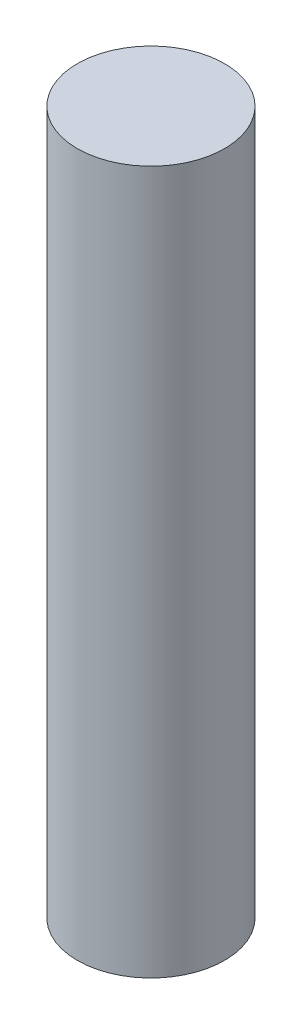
from build123d import *

# Parameters (mm, degrees)
SKETCH2_R           = 0.995
BOSS_EXTRUDE1_DEPTH = 9.5


with BuildPart() as part:
    # Sketch2 → Boss-Extrude1 (new body)
    with BuildSketch(Plane(origin=(0, 0, 0), x_dir=(1, 0, 0), z_dir=(0, 1, 0))):
        with Locations(Location((0, 0, 0), (0, 0, 270))):
            Circle(SKETCH2_R)
    extrude(amount=BOSS_EXTRUDE1_DEPTH)


solid = part.part
